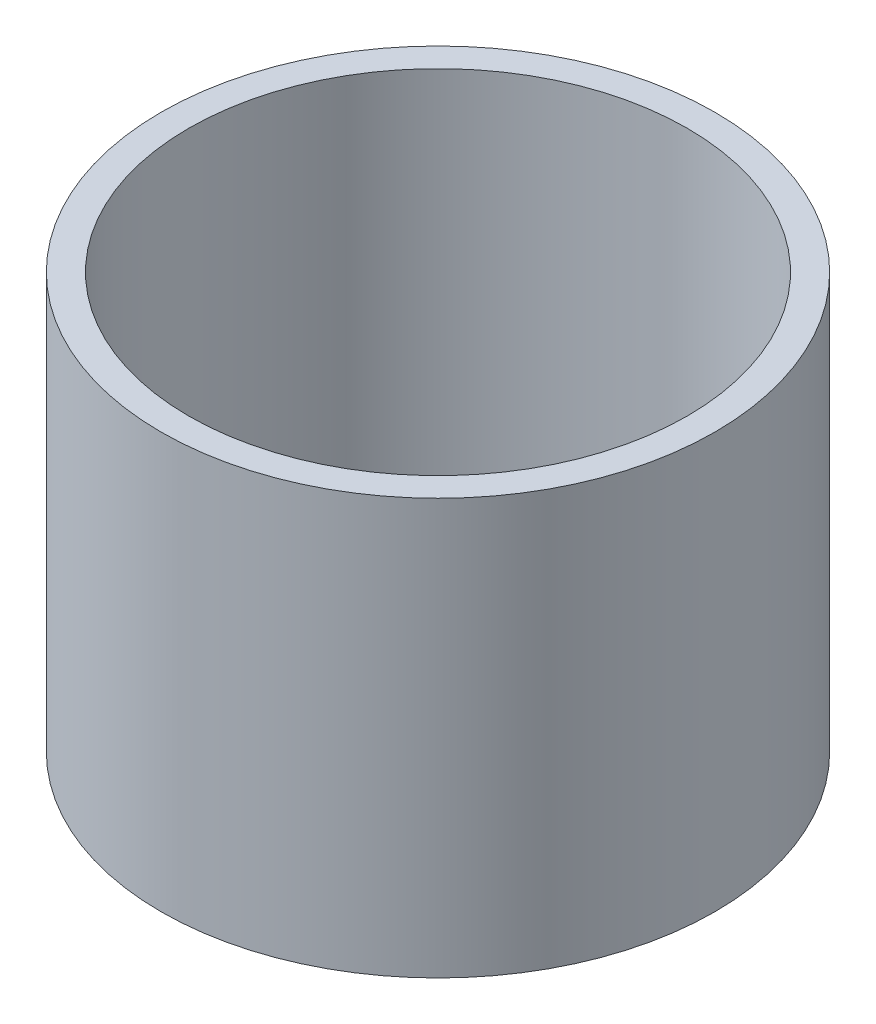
from build123d import *

# Parameters (mm, degrees)
ESBO_O2_R                = 100
ESBO_O2_R_2              = 90
RESSALTO_EXTRUS_O2_DEPTH = 150


with BuildPart() as part:
    # Esbo_o2 → Ressalto-extrus_o2 (new body)
    with BuildSketch(Plane(origin=(0, 0, 0), x_dir=(1, 0, 0), z_dir=(0, 1, 0))):
        with Locations(Location((0, 0, 0), (0, 0, 270))):
            Circle(ESBO_O2_R)
        with Locations(Location((0, 0, 0), (0, 0, 270))):
            Circle(ESBO_O2_R_2, mode=Mode.SUBTRACT)
    extrude(amount=RESSALTO_EXTRUS_O2_DEPTH)


solid = part.part
